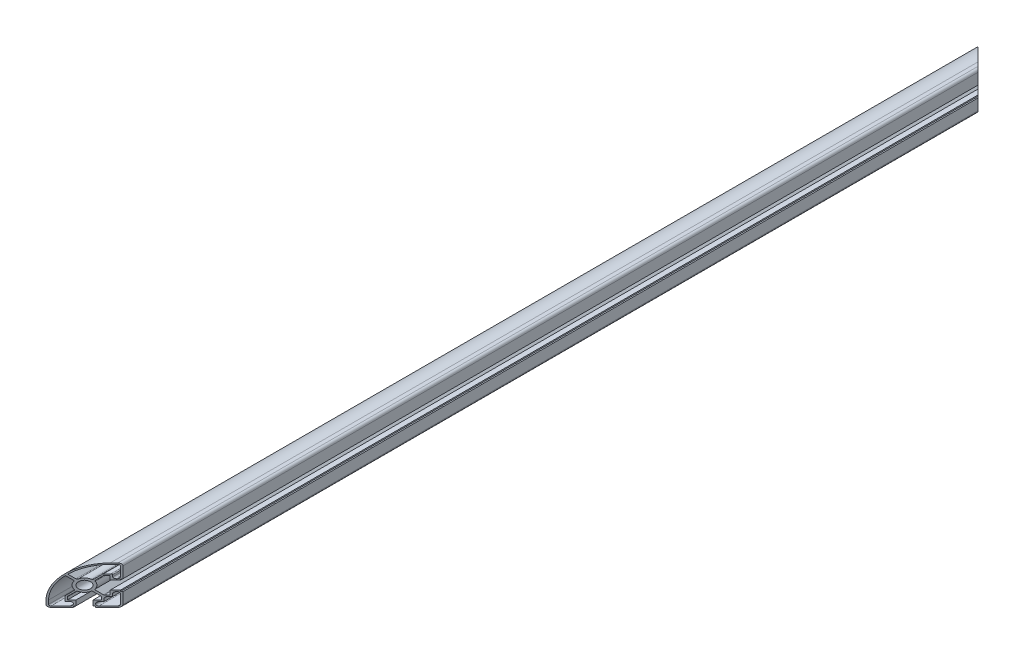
from build123d import *

# Parameters (mm, degrees)
LINEAR_START                    = -525.52883
SKIZZE1_R                       = 5
LINEAR_AUSTRAGEN1_DEPTH         = 1090.000001
SCHNITT_LINEAR_AUSTRAGEN2_DEPTH = 74.357312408


with BuildPart() as part:
    # Skizze1 → Linear austragen1 (new body)
    with BuildSketch(Plane.XY.offset(LINEAR_START)):
        with BuildLine():
            Line((-16, 0), (-3, 0))
            ThreePointArc((-3, 0), (-0.878679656, 0.878679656), (0, 3))
            Line((0, 3), (0, 16))
            Line((0, 16), (-1.5, 16))
            Line((-1.5, 16), (-1.5, 17.5))
            Line((-1.5, 17.5), (-7.5, 17.5))
            Line((-7.5, 17.5), (-7.5, 12.5))
            Line((-7.5, 12.5), (-10.671572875, 12.5))
            ThreePointArc((-10.671572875, 12.5), (-11.054256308, 12.576120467), (-11.378679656, 12.792893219))
            Line((-11.378679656, 12.792893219), (-16.667127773, 18.081341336))
            ThreePointArc((-16.667127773, 18.081341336), (-15.192648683, 22.113270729), (-16.233316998, 26.278310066))
            ThreePointArc((-16.233316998, 26.278310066), (-16.369567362, 26.915762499), (-16.084036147, 27.50175029))
            Line((-16.084036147, 27.50175029), (-11.378679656, 32.207106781))
            ThreePointArc((-11.378679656, 32.207106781), (-11.054256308, 32.423879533), (-10.671572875, 32.5))
            Line((-10.671572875, 32.5), (-7.5, 32.5))
            Line((-7.5, 32.5), (-7.5, 27.5))
            Line((-7.5, 27.5), (-1.5, 27.5))
            Line((-1.5, 27.5), (-1.5, 29))
            Line((-1.5, 29), (0, 29))
            Line((0, 29), (0, 42))
            ThreePointArc((0, 42), (-0.878679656, 44.121320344), (-3, 45))
            Line((-3, 45), (-7.5, 45))
            ThreePointArc((-7.5, 45), (-34.016504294, 34.016504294), (-45, 7.5))
            Line((-45, 7.5), (-45, 3))
            ThreePointArc((-45, 3), (-44.121320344, 0.878679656), (-42, 0))
            Line((-42, 0), (-29, 0))
            Line((-29, 0), (-29, 1.5))
            Line((-29, 1.5), (-27.5, 1.5))
            Line((-27.5, 1.5), (-27.5, 7.5))
            Line((-27.5, 7.5), (-32.5, 7.5))
            Line((-32.5, 7.5), (-32.5, 10.671572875))
            ThreePointArc((-32.5, 10.671572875), (-32.423879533, 11.054256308), (-32.207106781, 11.378679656))
            Line((-32.207106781, 11.378679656), (-27.50175029, 16.084036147))
            ThreePointArc((-27.50175029, 16.084036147), (-26.915762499, 16.369567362), (-26.278310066, 16.233316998))
            ThreePointArc((-26.278310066, 16.233316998), (-22.113270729, 15.192648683), (-18.081341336, 16.667127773))
            Line((-18.081341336, 16.667127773), (-12.792893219, 11.378679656))
            ThreePointArc((-12.792893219, 11.378679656), (-12.576120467, 11.054256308), (-12.5, 10.671572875))
            Line((-12.5, 10.671572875), (-12.5, 7.5))
            Line((-12.5, 7.5), (-17.5, 7.5))
            Line((-17.5, 7.5), (-17.5, 1.5))
            Line((-17.5, 1.5), (-16, 1.5))
            Line((-16, 1.5), (-16, 0))
        make_face()
        with BuildLine():
            Line((-14, 6), (-11, 6))
            Line((-11, 6), (-11, 9))
            ThreePointArc((-11, 9), (-10.414213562, 10.414213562), (-9, 11))
            Line((-9, 11), (-6, 11))
            Line((-6, 11), (-6, 14))
            ThreePointArc((-6, 14), (-5.414213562, 15.414213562), (-4, 16))
            Line((-4, 16), (-3.5, 16))
            ThreePointArc((-3.5, 16), (-2.085786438, 15.414213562), (-1.5, 14))
            Line((-1.5, 14), (-1.5, 3))
            ThreePointArc((-1.5, 3), (-1.939339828, 1.939339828), (-3, 1.5))
            Line((-3, 1.5), (-14, 1.5))
            ThreePointArc((-14, 1.5), (-15.414213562, 2.085786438), (-16, 3.5))
            Line((-16, 3.5), (-16, 4))
            ThreePointArc((-16, 4), (-15.414213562, 5.414213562), (-14, 6))
        make_face(mode=Mode.SUBTRACT)
        with BuildLine():
            Line((-27.50175029, 28.915963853), (-32.238914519, 33.653128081))
            ThreePointArc((-32.238914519, 33.653128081), (-20.813290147, 40.947814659), (-7.5, 43.5))
            Line((-7.5, 43.5), (-3, 43.5))
            ThreePointArc((-3, 43.5), (-1.939339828, 43.060660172), (-1.5, 42))
            Line((-1.5, 42), (-1.5, 31))
            ThreePointArc((-1.5, 31), (-2.085786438, 29.585786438), (-3.5, 29))
            Line((-3.5, 29), (-4, 29))
            ThreePointArc((-4, 29), (-5.414213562, 29.585786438), (-6, 31))
            Line((-6, 31), (-6, 33))
            ThreePointArc((-6, 33), (-6.292893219, 33.707106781), (-7, 34))
            Line((-7, 34), (-11.292893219, 34))
            ThreePointArc((-11.292893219, 34), (-11.675576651, 33.923879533), (-12, 33.707106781))
            Line((-12, 33.707106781), (-17.068568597, 28.638538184))
            ThreePointArc((-17.068568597, 28.638538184), (-17.685133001, 28.349752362), (-18.343668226, 28.522611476))
            ThreePointArc((-18.343668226, 28.522611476), (-22.275015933, 29.814118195), (-26.278310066, 28.766683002))
            ThreePointArc((-26.278310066, 28.766683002), (-26.915762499, 28.630432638), (-27.50175029, 28.915963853))
        make_face(mode=Mode.SUBTRACT)
        with BuildLine():
            Line((-33.653128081, 32.238914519), (-28.915963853, 27.50175029))
            ThreePointArc((-28.915963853, 27.50175029), (-28.630432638, 26.915762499), (-28.766683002, 26.278310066))
            ThreePointArc((-28.766683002, 26.278310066), (-29.814118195, 22.275015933), (-28.522611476, 18.343668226))
            ThreePointArc((-28.522611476, 18.343668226), (-28.349752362, 17.685133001), (-28.638538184, 17.068568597))
            Line((-28.638538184, 17.068568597), (-34, 11.707106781))
            Line((-34, 11.707106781), (-34, 6))
            Line((-34, 6), (-31, 6))
            ThreePointArc((-31, 6), (-29.585786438, 5.414213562), (-29, 4))
            Line((-29, 4), (-29, 3.5))
            ThreePointArc((-29, 3.5), (-29.585786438, 2.085786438), (-31, 1.5))
            Line((-31, 1.5), (-42, 1.5))
            ThreePointArc((-42, 1.5), (-43.060660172, 1.939339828), (-43.5, 3))
            Line((-43.5, 3), (-43.5, 7.5))
            ThreePointArc((-43.5, 7.5), (-40.947814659, 20.813290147), (-33.653128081, 32.238914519))
        make_face(mode=Mode.SUBTRACT)
        with Locations((-22.5, 22.5)):
            Circle(SKIZZE1_R, mode=Mode.SUBTRACT)
    extrude(amount=LINEAR_AUSTRAGEN1_DEPTH)

    # Skizze5 → Schnitt-Linear austragen2 (cut)
    with BuildSketch(Plane.XZ):
        Polygon((-45, -525.528829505), (0, -480.528829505), (0, -525.528829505), align=None)
        Polygon((-45, 564.471170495), (0, 519.471170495), (0, 564.471170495), align=None)
    extrude(amount=-SCHNITT_LINEAR_AUSTRAGEN2_DEPTH, mode=Mode.SUBTRACT)


with BuildPart() as schnitt_linear_austragen2_kept_piece:
    # of the separate pieces the step leaves, the one the design keeps (schnitt_linear_austragen2_pieces_kept)
    add(part.part.solids().sort_by_distance((-12.792893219, 11.378679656, -493.321722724))[0])


solid = schnitt_linear_austragen2_kept_piece.part
